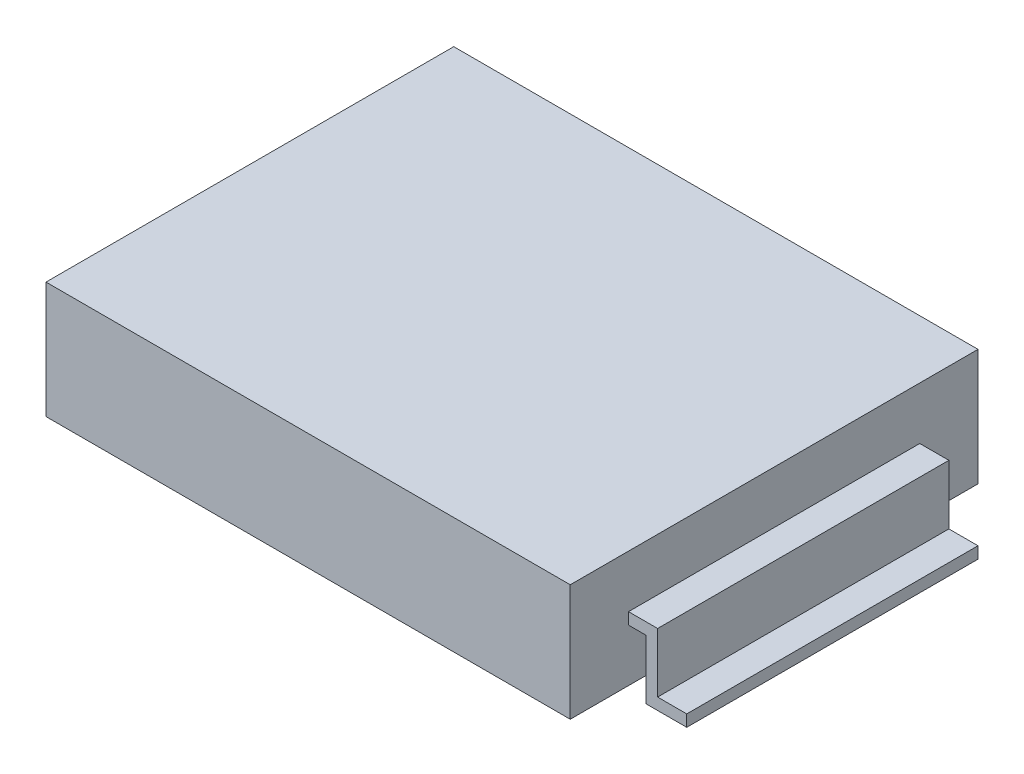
from build123d import *

# Parameters (mm, degrees)
SKETCH1_W           = 4.5
SKETCH1_H           = 3.5
EXTRUDE1_DEPTH      = 0.5
EXTRUDE_THIN1_DEPTH = 1.25


with BuildPart() as part:
    # Sketch1 → Extrude1 (new, symmetric)
    with BuildSketch(Plane(origin=(0, 0, 0), x_dir=(1, 0, 0), z_dir=(0, 1, 0))):
        Rectangle(SKETCH1_W, SKETCH1_H)
    extrude(amount=EXTRUDE1_DEPTH, both=True)

    # Sketch4 → Extrude-Thin1 (add, symmetric)
    with BuildSketch(Plane.XY):
        Polygon((-2.25, 0.05), (-2.5, 0.05), (-2.5, -0.46), (-2.75, -0.46), (-2.75, -0.56), (-2.4, -0.56), (-2.4, -0.05), (-2.25, -0.05), align=None)
    extrude_thin1 = extrude(amount=EXTRUDE_THIN1_DEPTH, both=True)

    # Mirror1: Extrude-Thin1 across plane
    add(extrude_thin1.mirror(Plane(origin=(0, 0, 0), x_dir=(0, 0, 1), z_dir=(1, 0, 0))))


solid = part.part
